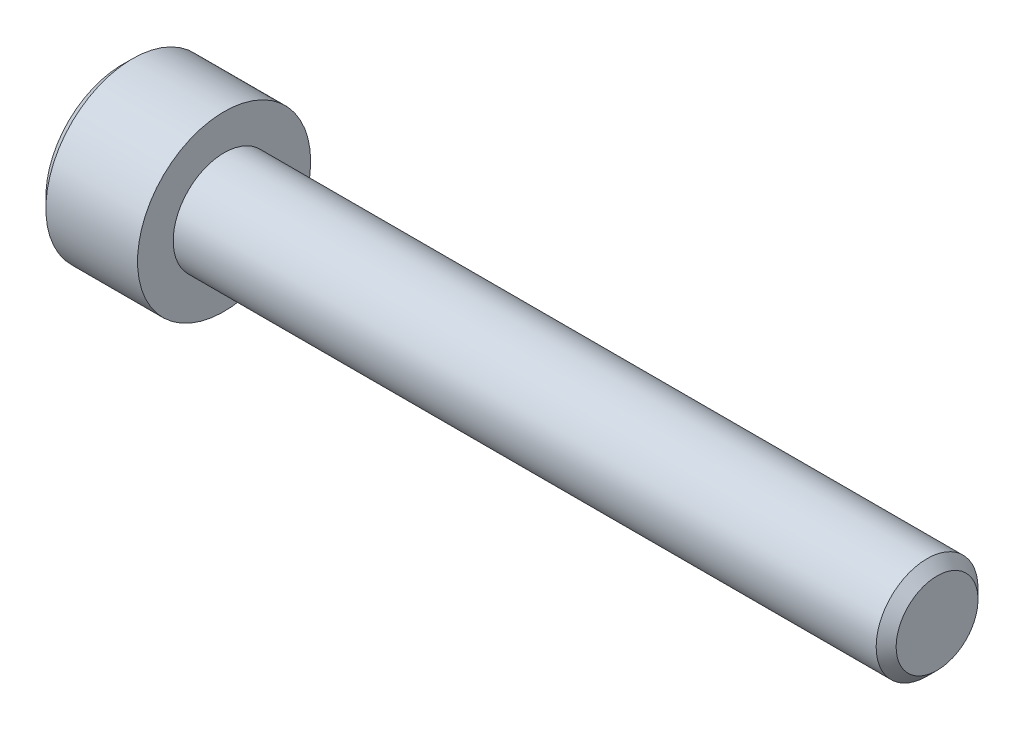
ISO-10303-21;
HEADER;
FILE_DESCRIPTION(('STEP AP214'),'2;1');
FILE_NAME('part.step','',(''),(''),'','','');
FILE_SCHEMA(('AUTOMOTIVE_DESIGN { 1 0 10303 214 1 1 1 1 }'));
ENDSEC;
DATA;
#1=APPLICATION_CONTEXT('core data for automotive mechanical design processes');
#2=APPLICATION_PROTOCOL_DEFINITION('international standard','automotive_design',2000,#1);
#3=PRODUCT_CONTEXT('',#1,'mechanical');
#4=PRODUCT('Part','Part','',(#3));
#5=PRODUCT_RELATED_PRODUCT_CATEGORY('part','',(#4));
#6=PRODUCT_DEFINITION_FORMATION('','',#4);
#7=PRODUCT_DEFINITION_CONTEXT('part definition',#1,'design');
#8=PRODUCT_DEFINITION('design','',#6,#7);
#9=PRODUCT_DEFINITION_SHAPE('','',#8);
#10=(LENGTH_UNIT() NAMED_UNIT(*) SI_UNIT(.MILLI.,.METRE.));
#11=(NAMED_UNIT(*) PLANE_ANGLE_UNIT() SI_UNIT($,.RADIAN.));
#12=(NAMED_UNIT(*) SI_UNIT($,.STERADIAN.) SOLID_ANGLE_UNIT());
#13=UNCERTAINTY_MEASURE_WITH_UNIT(LENGTH_MEASURE(1.E-05),#10,'distance_accuracy_value','');
#14=(GEOMETRIC_REPRESENTATION_CONTEXT(3) GLOBAL_UNCERTAINTY_ASSIGNED_CONTEXT((#13)) GLOBAL_UNIT_ASSIGNED_CONTEXT((#10,
#11,#12)) REPRESENTATION_CONTEXT('',''));
#15=CARTESIAN_POINT('',(0.,0.,0.));
#16=DIRECTION('',(0.,0.,1.));
#17=DIRECTION('',(1.,0.,0.));
#18=AXIS2_PLACEMENT_3D('',#15,#16,#17);
#19=CARTESIAN_POINT('',(-12.5,0.,0.));
#20=DIRECTION('',(1.,0.,0.));
#21=DIRECTION('',(0.,0.,-1.));
#22=AXIS2_PLACEMENT_3D('',#19,#20,#21);
#23=PLANE('',#22);
#24=DIRECTION('',(0.,1.,0.));
#25=VECTOR('',#24,1.);
#26=CARTESIAN_POINT('',(-12.5,0.,-2.));
#27=LINE('',#26,#25);
#28=CARTESIAN_POINT('',(-12.5,-1.15470053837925,-2.));
#29=VERTEX_POINT('',#28);
#30=CARTESIAN_POINT('',(-12.4999999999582,-7.75257295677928E-13,-1.99999999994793));
#31=VERTEX_POINT('',#30);
#32=EDGE_CURVE('E88',#29,#31,#27,.T.);
#33=ORIENTED_EDGE('',*,*,#32,.F.);
#34=DIRECTION('',(0.,0.499999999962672,-0.86602540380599));
#35=VECTOR('',#34,1.);
#36=CARTESIAN_POINT('',(-12.5,-1.73205080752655,-0.999999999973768));
#37=LINE('',#36,#35);
#38=CARTESIAN_POINT('',(-12.4999999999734,-1.7320508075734,-0.999999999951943));
#39=VERTEX_POINT('',#38);
#40=EDGE_CURVE('E110',#39,#29,#37,.T.);
#41=ORIENTED_EDGE('',*,*,#40,.F.);
#42=CARTESIAN_POINT('',(-12.4999999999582,0.,0.));
#43=DIRECTION('',(-1.,0.,0.));
#44=DIRECTION('',(0.,0.,1.));
#45=AXIS2_PLACEMENT_3D('',#42,#43,#44);
#46=CIRCLE('',#45,1.99999999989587);
#47=EDGE_CURVE('E19',#39,#31,#46,.F.);
#48=ORIENTED_EDGE('',*,*,#47,.T.);
#49=EDGE_LOOP('',(#33,#41,#48));
#50=FACE_BOUND('',#49,.T.);
#51=ADVANCED_FACE('F16',(#50),#23,.F.);
#52=CARTESIAN_POINT('',(-12.5,0.,0.));
#53=DIRECTION('',(1.,0.,0.));
#54=DIRECTION('',(0.,0.,-1.));
#55=AXIS2_PLACEMENT_3D('',#52,#53,#54);
#56=PLANE('',#55);
#57=DIRECTION('',(0.,0.5,0.866025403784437));
#58=VECTOR('',#57,1.);
#59=CARTESIAN_POINT('',(-12.5,1.15470053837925,-2.));
#60=LINE('',#59,#58);
#61=CARTESIAN_POINT('',(-12.5,1.15470053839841,-1.99999999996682));
#62=VERTEX_POINT('',#61);
#63=CARTESIAN_POINT('',(-12.4999999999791,1.73205080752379,-0.999999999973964));
#64=VERTEX_POINT('',#63);
#65=EDGE_CURVE('E122',#62,#64,#60,.T.);
#66=ORIENTED_EDGE('',*,*,#65,.F.);
#67=DIRECTION('',(0.,1.,0.));
#68=VECTOR('',#67,1.);
#69=CARTESIAN_POINT('',(-12.5,0.,-1.99999999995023));
#70=LINE('',#69,#68);
#71=EDGE_CURVE('E125',#31,#62,#70,.T.);
#72=ORIENTED_EDGE('',*,*,#71,.F.);
#73=CARTESIAN_POINT('',(-12.4999999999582,0.,0.));
#74=DIRECTION('',(-1.,0.,0.));
#75=DIRECTION('',(0.,0.,1.));
#76=AXIS2_PLACEMENT_3D('',#73,#74,#75);
#77=CIRCLE('',#76,1.99999999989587);
#78=EDGE_CURVE('E121',#31,#64,#77,.F.);
#79=ORIENTED_EDGE('',*,*,#78,.T.);
#80=EDGE_LOOP('',(#66,#72,#79));
#81=FACE_BOUND('',#80,.T.);
#82=ADVANCED_FACE('F400',(#81),#56,.F.);
#83=CARTESIAN_POINT('',(-12.5,0.,0.));
#84=DIRECTION('',(1.,0.,0.));
#85=DIRECTION('',(0.,0.,-1.));
#86=AXIS2_PLACEMENT_3D('',#83,#84,#85);
#87=PLANE('',#86);
#88=DIRECTION('',(0.,1.,0.));
#89=VECTOR('',#88,1.);
#90=CARTESIAN_POINT('',(-12.5,0.,2.));
#91=LINE('',#90,#89);
#92=CARTESIAN_POINT('',(-12.5,1.15470053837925,2.));
#93=VERTEX_POINT('',#92);
#94=CARTESIAN_POINT('',(-12.4999999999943,0.,2.00000000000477));
#95=VERTEX_POINT('',#94);
#96=EDGE_CURVE('E171',#93,#95,#91,.F.);
#97=ORIENTED_EDGE('',*,*,#96,.F.);
#98=DIRECTION('',(0.,-0.5,0.866025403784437));
#99=VECTOR('',#98,1.);
#100=CARTESIAN_POINT('',(-12.5,1.73205080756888,1.));
#101=LINE('',#100,#99);
#102=CARTESIAN_POINT('',(-12.4999999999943,1.73205080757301,1.00000000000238));
#103=VERTEX_POINT('',#102);
#104=EDGE_CURVE('E123',#103,#93,#101,.T.);
#105=ORIENTED_EDGE('',*,*,#104,.F.);
#106=CARTESIAN_POINT('',(-12.4999999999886,0.,0.));
#107=DIRECTION('',(-1.,0.,0.));
#108=DIRECTION('',(0.,0.,1.));
#109=AXIS2_PLACEMENT_3D('',#106,#107,#108);
#110=CIRCLE('',#109,2.00000000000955);
#111=EDGE_CURVE('E104',#103,#95,#110,.F.);
#112=ORIENTED_EDGE('',*,*,#111,.T.);
#113=EDGE_LOOP('',(#97,#105,#112));
#114=FACE_BOUND('',#113,.T.);
#115=ADVANCED_FACE('F392',(#114),#87,.F.);
#116=CARTESIAN_POINT('',(-12.4999999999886,0.,0.));
#117=DIRECTION('',(-1.,0.,0.));
#118=DIRECTION('',(0.,0.,1.));
#119=AXIS2_PLACEMENT_3D('',#116,#117,#118);
#120=CONICAL_SURFACE('',#119,2.00000000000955,1.30899693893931);
#121=CARTESIAN_POINT('',(-11.9641016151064,-5.11590769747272E-10,0.));
#122=VERTEX_POINT('',#121);
#123=VERTEX_LOOP('',#122);
#124=FACE_BOUND('',#123,.T.);
#125=CARTESIAN_POINT('',(-12.4999999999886,0.,0.));
#126=DIRECTION('',(-1.,0.,0.));
#127=DIRECTION('',(0.,0.,1.));
#128=AXIS2_PLACEMENT_3D('',#125,#126,#127);
#129=CIRCLE('',#128,2.00000000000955);
#130=CARTESIAN_POINT('',(-12.4999999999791,-1.73205080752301,0.999999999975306));
#131=VERTEX_POINT('',#130);
#132=EDGE_CURVE('E103',#131,#95,#129,.T.);
#133=ORIENTED_EDGE('',*,*,#132,.T.);
#134=ORIENTED_EDGE('',*,*,#111,.F.);
#135=CARTESIAN_POINT('',(-12.4999999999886,0.,0.));
#136=DIRECTION('',(-1.,0.,0.));
#137=DIRECTION('',(0.,0.,1.));
#138=AXIS2_PLACEMENT_3D('',#135,#136,#137);
#139=CIRCLE('',#138,2.00000000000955);
#140=EDGE_CURVE('E170',#64,#103,#139,.F.);
#141=ORIENTED_EDGE('',*,*,#140,.F.);
#142=ORIENTED_EDGE('',*,*,#78,.F.);
#143=ORIENTED_EDGE('',*,*,#47,.F.);
#144=CARTESIAN_POINT('',(-12.4999999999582,0.,0.));
#145=DIRECTION('',(-1.,0.,0.));
#146=DIRECTION('',(0.,0.,1.));
#147=AXIS2_PLACEMENT_3D('',#144,#145,#146);
#148=CIRCLE('',#147,1.99999999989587);
#149=EDGE_CURVE('E93',#131,#39,#148,.F.);
#150=ORIENTED_EDGE('',*,*,#149,.F.);
#151=EDGE_LOOP('',(#133,#134,#141,#142,#143,#150));
#152=FACE_BOUND('',#151,.T.);
#153=ADVANCED_FACE('F119',(#124,#152),#120,.F.);
#154=CARTESIAN_POINT('',(-12.5,0.,0.));
#155=DIRECTION('',(1.,0.,0.));
#156=DIRECTION('',(0.,0.,-1.));
#157=AXIS2_PLACEMENT_3D('',#154,#155,#156);
#158=PLANE('',#157);
#159=DIRECTION('',(0.,-0.5,-0.866025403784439));
#160=VECTOR('',#159,1.);
#161=CARTESIAN_POINT('',(-12.4999999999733,-2.3094010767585,0.));
#162=LINE('',#161,#160);
#163=CARTESIAN_POINT('',(-12.4999999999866,-1.15470053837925,2.));
#164=VERTEX_POINT('',#163);
#165=EDGE_CURVE('E206',#131,#164,#162,.F.);
#166=ORIENTED_EDGE('',*,*,#165,.T.);
#167=DIRECTION('',(0.,1.,0.));
#168=VECTOR('',#167,1.);
#169=CARTESIAN_POINT('',(-12.5,-1.15470053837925,2.));
#170=LINE('',#169,#168);
#171=EDGE_CURVE('E166',#164,#95,#170,.T.);
#172=ORIENTED_EDGE('',*,*,#171,.T.);
#173=ORIENTED_EDGE('',*,*,#132,.F.);
#174=EDGE_LOOP('',(#166,#172,#173));
#175=FACE_BOUND('',#174,.T.);
#176=ADVANCED_FACE('F378',(#175),#158,.F.);
#177=CARTESIAN_POINT('',(-12.5,0.,0.));
#178=DIRECTION('',(1.,0.,0.));
#179=DIRECTION('',(0.,0.,-1.));
#180=AXIS2_PLACEMENT_3D('',#177,#178,#179);
#181=PLANE('',#180);
#182=ORIENTED_EDGE('',*,*,#149,.T.);
#183=DIRECTION('',(0.,0.5,-0.866025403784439));
#184=VECTOR('',#183,1.);
#185=CARTESIAN_POINT('',(-12.4999999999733,-1.15470053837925,-2.));
#186=LINE('',#185,#184);
#187=CARTESIAN_POINT('',(-12.4999999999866,-2.3094010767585,0.));
#188=VERTEX_POINT('',#187);
#189=EDGE_CURVE('E96',#39,#188,#186,.F.);
#190=ORIENTED_EDGE('',*,*,#189,.T.);
#191=DIRECTION('',(0.,-0.5,-0.866025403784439));
#192=VECTOR('',#191,1.);
#193=CARTESIAN_POINT('',(-12.5,-2.3094010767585,0.));
#194=LINE('',#193,#192);
#195=EDGE_CURVE('E98',#188,#131,#194,.F.);
#196=ORIENTED_EDGE('',*,*,#195,.T.);
#197=EDGE_LOOP('',(#182,#190,#196));
#198=FACE_BOUND('',#197,.T.);
#199=ADVANCED_FACE('F95',(#198),#181,.F.);
#200=CARTESIAN_POINT('',(-12.5,0.,0.));
#201=DIRECTION('',(1.,0.,0.));
#202=DIRECTION('',(0.,0.,-1.));
#203=AXIS2_PLACEMENT_3D('',#200,#201,#202);
#204=PLANE('',#203);
#205=ORIENTED_EDGE('',*,*,#140,.T.);
#206=DIRECTION('',(0.,-0.5,0.866025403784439));
#207=VECTOR('',#206,1.);
#208=CARTESIAN_POINT('',(-12.5,1.15470053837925,2.));
#209=LINE('',#208,#207);
#210=CARTESIAN_POINT('',(-12.5,2.3094010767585,0.));
#211=VERTEX_POINT('',#210);
#212=EDGE_CURVE('E188',#103,#211,#209,.F.);
#213=ORIENTED_EDGE('',*,*,#212,.T.);
#214=DIRECTION('',(0.,0.5,0.866025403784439));
#215=VECTOR('',#214,1.);
#216=CARTESIAN_POINT('',(-12.5,2.3094010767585,0.));
#217=LINE('',#216,#215);
#218=EDGE_CURVE('E146',#211,#64,#217,.F.);
#219=ORIENTED_EDGE('',*,*,#218,.T.);
#220=EDGE_LOOP('',(#205,#213,#219));
#221=FACE_BOUND('',#220,.T.);
#222=ADVANCED_FACE('F365',(#221),#204,.F.);
#223=CARTESIAN_POINT('',(-15.,-1.15470053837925,2.));
#224=DIRECTION('',(0.,0.,1.));
#225=DIRECTION('',(1.,0.,0.));
#226=AXIS2_PLACEMENT_3D('',#223,#224,#225);
#227=PLANE('',#226);
#228=DIRECTION('',(1.,0.,0.));
#229=VECTOR('',#228,1.);
#230=CARTESIAN_POINT('',(-15.,1.15470053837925,2.));
#231=LINE('',#230,#229);
#232=CARTESIAN_POINT('',(-15.,1.15470053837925,2.));
#233=VERTEX_POINT('',#232);
#234=EDGE_CURVE('E145',#233,#93,#231,.T.);
#235=ORIENTED_EDGE('',*,*,#234,.T.);
#236=ORIENTED_EDGE('',*,*,#96,.T.);
#237=ORIENTED_EDGE('',*,*,#171,.F.);
#238=DIRECTION('',(1.,0.,0.));
#239=VECTOR('',#238,1.);
#240=CARTESIAN_POINT('',(-15.,-1.15470053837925,2.));
#241=LINE('',#240,#239);
#242=CARTESIAN_POINT('',(-15.,-1.15470053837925,2.));
#243=VERTEX_POINT('',#242);
#244=EDGE_CURVE('E113',#164,#243,#241,.F.);
#245=ORIENTED_EDGE('',*,*,#244,.T.);
#246=DIRECTION('',(0.,1.,0.));
#247=VECTOR('',#246,1.);
#248=CARTESIAN_POINT('',(-15.,1.875,2.));
#249=LINE('',#248,#247);
#250=EDGE_CURVE('E191',#233,#243,#249,.F.);
#251=ORIENTED_EDGE('',*,*,#250,.F.);
#252=EDGE_LOOP('',(#235,#236,#237,#245,#251));
#253=FACE_BOUND('',#252,.T.);
#254=ADVANCED_FACE('F220',(#253),#227,.F.);
#255=CARTESIAN_POINT('',(-15.,-2.3094010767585,0.));
#256=DIRECTION('',(0.,-0.866025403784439,0.5));
#257=DIRECTION('',(0.,-0.5,-0.866025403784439));
#258=AXIS2_PLACEMENT_3D('',#255,#256,#257);
#259=PLANE('',#258);
#260=ORIENTED_EDGE('',*,*,#244,.F.);
#261=ORIENTED_EDGE('',*,*,#165,.F.);
#262=ORIENTED_EDGE('',*,*,#195,.F.);
#263=DIRECTION('',(1.,0.,0.));
#264=VECTOR('',#263,1.);
#265=CARTESIAN_POINT('',(-15.,-2.3094010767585,0.));
#266=LINE('',#265,#264);
#267=CARTESIAN_POINT('',(-15.,-2.3094010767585,0.));
#268=VERTEX_POINT('',#267);
#269=EDGE_CURVE('E112',#188,#268,#266,.F.);
#270=ORIENTED_EDGE('',*,*,#269,.T.);
#271=DIRECTION('',(0.,-0.5,-0.866025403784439));
#272=VECTOR('',#271,1.);
#273=CARTESIAN_POINT('',(-15.,-1.15470053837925,2.));
#274=LINE('',#273,#272);
#275=EDGE_CURVE('E225',#243,#268,#274,.T.);
#276=ORIENTED_EDGE('',*,*,#275,.F.);
#277=EDGE_LOOP('',(#260,#261,#262,#270,#276));
#278=FACE_BOUND('',#277,.T.);
#279=ADVANCED_FACE('F226',(#278),#259,.F.);
#280=CARTESIAN_POINT('',(-15.,-1.15470053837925,-2.));
#281=DIRECTION('',(0.,-0.866025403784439,-0.5));
#282=DIRECTION('',(0.,0.5,-0.866025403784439));
#283=AXIS2_PLACEMENT_3D('',#280,#281,#282);
#284=PLANE('',#283);
#285=ORIENTED_EDGE('',*,*,#269,.F.);
#286=ORIENTED_EDGE('',*,*,#189,.F.);
#287=ORIENTED_EDGE('',*,*,#40,.T.);
#288=DIRECTION('',(-1.,0.,0.));
#289=VECTOR('',#288,1.);
#290=CARTESIAN_POINT('',(-15.,-1.15470053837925,-2.));
#291=LINE('',#290,#289);
#292=CARTESIAN_POINT('',(-15.,-1.15470053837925,-2.));
#293=VERTEX_POINT('',#292);
#294=EDGE_CURVE('E149',#29,#293,#291,.T.);
#295=ORIENTED_EDGE('',*,*,#294,.T.);
#296=DIRECTION('',(0.,0.5,-0.866025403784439));
#297=VECTOR('',#296,1.);
#298=CARTESIAN_POINT('',(-15.,-2.3094010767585,0.));
#299=LINE('',#298,#297);
#300=EDGE_CURVE('E229',#268,#293,#299,.T.);
#301=ORIENTED_EDGE('',*,*,#300,.F.);
#302=EDGE_LOOP('',(#285,#286,#287,#295,#301));
#303=FACE_BOUND('',#302,.T.);
#304=ADVANCED_FACE('F109',(#303),#284,.F.);
#305=CARTESIAN_POINT('',(-15.,1.15470053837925,-2.));
#306=DIRECTION('',(0.,0.,-1.));
#307=DIRECTION('',(-1.,0.,0.));
#308=AXIS2_PLACEMENT_3D('',#305,#306,#307);
#309=PLANE('',#308);
#310=ORIENTED_EDGE('',*,*,#294,.F.);
#311=ORIENTED_EDGE('',*,*,#32,.T.);
#312=ORIENTED_EDGE('',*,*,#71,.T.);
#313=DIRECTION('',(1.,0.,0.));
#314=VECTOR('',#313,1.);
#315=CARTESIAN_POINT('',(-15.,1.15470053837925,-2.));
#316=LINE('',#315,#314);
#317=CARTESIAN_POINT('',(-15.,1.15470053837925,-2.));
#318=VERTEX_POINT('',#317);
#319=EDGE_CURVE('E143',#62,#318,#316,.F.);
#320=ORIENTED_EDGE('',*,*,#319,.T.);
#321=DIRECTION('',(0.,1.,0.));
#322=VECTOR('',#321,1.);
#323=CARTESIAN_POINT('',(-15.,1.875,-2.));
#324=LINE('',#323,#322);
#325=EDGE_CURVE('E237',#293,#318,#324,.T.);
#326=ORIENTED_EDGE('',*,*,#325,.F.);
#327=EDGE_LOOP('',(#310,#311,#312,#320,#326));
#328=FACE_BOUND('',#327,.T.);
#329=ADVANCED_FACE('F243',(#328),#309,.F.);
#330=CARTESIAN_POINT('',(-15.,2.3094010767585,0.));
#331=DIRECTION('',(0.,0.866025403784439,-0.5));
#332=DIRECTION('',(0.,0.5,0.866025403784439));
#333=AXIS2_PLACEMENT_3D('',#330,#331,#332);
#334=PLANE('',#333);
#335=ORIENTED_EDGE('',*,*,#319,.F.);
#336=ORIENTED_EDGE('',*,*,#65,.T.);
#337=ORIENTED_EDGE('',*,*,#218,.F.);
#338=DIRECTION('',(1.,0.,0.));
#339=VECTOR('',#338,1.);
#340=CARTESIAN_POINT('',(-15.,2.3094010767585,0.));
#341=LINE('',#340,#339);
#342=CARTESIAN_POINT('',(-15.,2.3094010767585,0.));
#343=VERTEX_POINT('',#342);
#344=EDGE_CURVE('E34',#211,#343,#341,.F.);
#345=ORIENTED_EDGE('',*,*,#344,.T.);
#346=DIRECTION('',(0.,0.5,0.866025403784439));
#347=VECTOR('',#346,1.);
#348=CARTESIAN_POINT('',(-15.,1.15470053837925,-2.));
#349=LINE('',#348,#347);
#350=EDGE_CURVE('E234',#318,#343,#349,.T.);
#351=ORIENTED_EDGE('',*,*,#350,.F.);
#352=EDGE_LOOP('',(#335,#336,#337,#345,#351));
#353=FACE_BOUND('',#352,.T.);
#354=ADVANCED_FACE('F244',(#353),#334,.F.);
#355=CARTESIAN_POINT('',(-15.,1.15470053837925,2.));
#356=DIRECTION('',(0.,0.866025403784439,0.5));
#357=DIRECTION('',(0.,-0.5,0.866025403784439));
#358=AXIS2_PLACEMENT_3D('',#355,#356,#357);
#359=PLANE('',#358);
#360=ORIENTED_EDGE('',*,*,#344,.F.);
#361=ORIENTED_EDGE('',*,*,#212,.F.);
#362=ORIENTED_EDGE('',*,*,#104,.T.);
#363=ORIENTED_EDGE('',*,*,#234,.F.);
#364=DIRECTION('',(0.,-0.5,0.866025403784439));
#365=VECTOR('',#364,1.);
#366=CARTESIAN_POINT('',(-15.,2.3094010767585,0.));
#367=LINE('',#366,#365);
#368=EDGE_CURVE('E165',#343,#233,#367,.T.);
#369=ORIENTED_EDGE('',*,*,#368,.F.);
#370=EDGE_LOOP('',(#360,#361,#362,#363,#369));
#371=FACE_BOUND('',#370,.T.);
#372=ADVANCED_FACE('F246',(#371),#359,.F.);
#373=CARTESIAN_POINT('',(-15.,1.875,0.));
#374=DIRECTION('',(-1.,0.,0.));
#375=DIRECTION('',(0.,0.,1.));
#376=AXIS2_PLACEMENT_3D('',#373,#374,#375);
#377=PLANE('',#376);
#378=CARTESIAN_POINT('',(-14.9999999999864,0.,0.));
#379=DIRECTION('',(1.,0.,0.));
#380=DIRECTION('',(0.,0.,-1.));
#381=AXIS2_PLACEMENT_3D('',#378,#379,#380);
#382=CIRCLE('',#381,3.75000000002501);
#383=CARTESIAN_POINT('',(-14.9999999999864,0.,-3.75000000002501));
#384=VERTEX_POINT('',#383);
#385=EDGE_CURVE('E162',#384,#384,#382,.T.);
#386=ORIENTED_EDGE('',*,*,#385,.F.);
#387=EDGE_LOOP('',(#386));
#388=FACE_BOUND('',#387,.T.);
#389=ORIENTED_EDGE('',*,*,#350,.T.);
#390=ORIENTED_EDGE('',*,*,#368,.T.);
#391=ORIENTED_EDGE('',*,*,#250,.T.);
#392=ORIENTED_EDGE('',*,*,#275,.T.);
#393=ORIENTED_EDGE('',*,*,#300,.T.);
#394=ORIENTED_EDGE('',*,*,#325,.T.);
#395=EDGE_LOOP('',(#389,#390,#391,#392,#393,#394));
#396=FACE_BOUND('',#395,.T.);
#397=ADVANCED_FACE('F232',(#388,#396),#377,.T.);
#398=CARTESIAN_POINT('',(-14.4999999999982,0.,0.));
#399=DIRECTION('',(1.,0.,0.));
#400=DIRECTION('',(0.,0.,-1.));
#401=AXIS2_PLACEMENT_3D('',#398,#399,#400);
#402=CONICAL_SURFACE('',#401,4.25000000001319,0.785398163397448);
#403=CARTESIAN_POINT('',(-14.5,0.,0.));
#404=DIRECTION('',(1.,0.,0.));
#405=DIRECTION('',(0.,0.,-1.));
#406=AXIS2_PLACEMENT_3D('',#403,#404,#405);
#407=CIRCLE('',#406,4.25);
#408=CARTESIAN_POINT('',(-14.5,0.,-4.25));
#409=VERTEX_POINT('',#408);
#410=EDGE_CURVE('E161',#409,#409,#407,.T.);
#411=ORIENTED_EDGE('',*,*,#410,.F.);
#412=EDGE_LOOP('',(#411));
#413=FACE_BOUND('',#412,.T.);
#414=ORIENTED_EDGE('',*,*,#385,.T.);
#415=EDGE_LOOP('',(#414));
#416=FACE_BOUND('',#415,.T.);
#417=ADVANCED_FACE('F280',(#413,#416),#402,.T.);
#418=CARTESIAN_POINT('',(-12.25,0.,0.));
#419=DIRECTION('',(1.,0.,0.));
#420=DIRECTION('',(0.,0.,-1.));
#421=AXIS2_PLACEMENT_3D('',#418,#419,#420);
#422=CYLINDRICAL_SURFACE('',#421,4.25);
#423=ORIENTED_EDGE('',*,*,#410,.T.);
#424=EDGE_LOOP('',(#423));
#425=FACE_BOUND('',#424,.T.);
#426=CARTESIAN_POINT('',(-10.,0.,0.));
#427=DIRECTION('',(1.,0.,0.));
#428=DIRECTION('',(0.,0.,-1.));
#429=AXIS2_PLACEMENT_3D('',#426,#427,#428);
#430=CIRCLE('',#429,4.25);
#431=CARTESIAN_POINT('',(-10.,0.,-4.25));
#432=VERTEX_POINT('',#431);
#433=EDGE_CURVE('E158',#432,#432,#430,.T.);
#434=ORIENTED_EDGE('',*,*,#433,.F.);
#435=EDGE_LOOP('',(#434));
#436=FACE_BOUND('',#435,.T.);
#437=ADVANCED_FACE('F276',(#425,#436),#422,.T.);
#438=CARTESIAN_POINT('',(25.,1.00475,0.));
#439=DIRECTION('',(1.,0.,0.));
#440=DIRECTION('',(0.,0.,-1.));
#441=AXIS2_PLACEMENT_3D('',#438,#439,#440);
#442=PLANE('',#441);
#443=CARTESIAN_POINT('',(25.0000000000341,0.,0.));
#444=DIRECTION('',(-1.,0.,0.));
#445=DIRECTION('',(0.,0.,1.));
#446=AXIS2_PLACEMENT_3D('',#443,#444,#445);
#447=CIRCLE('',#446,2.00949999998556);
#448=CARTESIAN_POINT('',(25.0000000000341,0.,2.00949999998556));
#449=VERTEX_POINT('',#448);
#450=EDGE_CURVE('E155',#449,#449,#447,.T.);
#451=ORIENTED_EDGE('',*,*,#450,.F.);
#452=EDGE_LOOP('',(#451));
#453=FACE_BOUND('',#452,.T.);
#454=ADVANCED_FACE('F272',(#453),#442,.T.);
#455=CARTESIAN_POINT('',(-10.,3.375,0.));
#456=DIRECTION('',(1.,0.,0.));
#457=DIRECTION('',(0.,0.,-1.));
#458=AXIS2_PLACEMENT_3D('',#455,#456,#457);
#459=PLANE('',#458);
#460=ORIENTED_EDGE('',*,*,#433,.T.);
#461=EDGE_LOOP('',(#460));
#462=FACE_BOUND('',#461,.T.);
#463=CARTESIAN_POINT('',(-10.,0.,0.));
#464=DIRECTION('',(1.,0.,0.));
#465=DIRECTION('',(0.,0.,-1.));
#466=AXIS2_PLACEMENT_3D('',#463,#464,#465);
#467=CIRCLE('',#466,2.5);
#468=CARTESIAN_POINT('',(-10.,0.,-2.5));
#469=VERTEX_POINT('',#468);
#470=EDGE_CURVE('E25',#469,#469,#467,.T.);
#471=ORIENTED_EDGE('',*,*,#470,.F.);
#472=EDGE_LOOP('',(#471));
#473=FACE_BOUND('',#472,.T.);
#474=ADVANCED_FACE('F265',(#462,#473),#459,.T.);
#475=CARTESIAN_POINT('',(24.509500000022,0.,0.));
#476=DIRECTION('',(-1.,0.,0.));
#477=DIRECTION('',(0.,0.,1.));
#478=AXIS2_PLACEMENT_3D('',#475,#476,#477);
#479=CONICAL_SURFACE('',#478,2.50000000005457,0.785398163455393);
#480=ORIENTED_EDGE('',*,*,#450,.T.);
#481=EDGE_LOOP('',(#480));
#482=FACE_BOUND('',#481,.T.);
#483=CARTESIAN_POINT('',(24.5095,0.,0.));
#484=DIRECTION('',(1.,0.,0.));
#485=DIRECTION('',(0.,0.,-1.));
#486=AXIS2_PLACEMENT_3D('',#483,#484,#485);
#487=CIRCLE('',#486,2.5);
#488=CARTESIAN_POINT('',(24.5095,0.,-2.5));
#489=VERTEX_POINT('',#488);
#490=EDGE_CURVE('E11',#489,#489,#487,.F.);
#491=ORIENTED_EDGE('',*,*,#490,.F.);
#492=EDGE_LOOP('',(#491));
#493=FACE_BOUND('',#492,.T.);
#494=ADVANCED_FACE('F258',(#482,#493),#479,.T.);
#495=CARTESIAN_POINT('',(12.25475,0.,0.));
#496=DIRECTION('',(1.,0.,0.));
#497=DIRECTION('',(0.,0.,-1.));
#498=AXIS2_PLACEMENT_3D('',#495,#496,#497);
#499=CYLINDRICAL_SURFACE('',#498,2.5);
#500=ORIENTED_EDGE('',*,*,#490,.T.);
#501=EDGE_LOOP('',(#500));
#502=FACE_BOUND('',#501,.T.);
#503=ORIENTED_EDGE('',*,*,#470,.T.);
#504=EDGE_LOOP('',(#503));
#505=FACE_BOUND('',#504,.T.);
#506=ADVANCED_FACE('F256',(#502,#505),#499,.T.);
#507=CLOSED_SHELL('',(#51,#82,#115,#153,#176,#199,#222,#254,#279,#304,#329,#354,#372,#397,#417,
#437,#454,#474,#494,#506));
#508=MANIFOLD_SOLID_BREP('B1',#507);
#509=ADVANCED_BREP_SHAPE_REPRESENTATION('',(#18,#508),#14);
#510=SHAPE_DEFINITION_REPRESENTATION(#9,#509);
ENDSEC;
END-ISO-10303-21;
